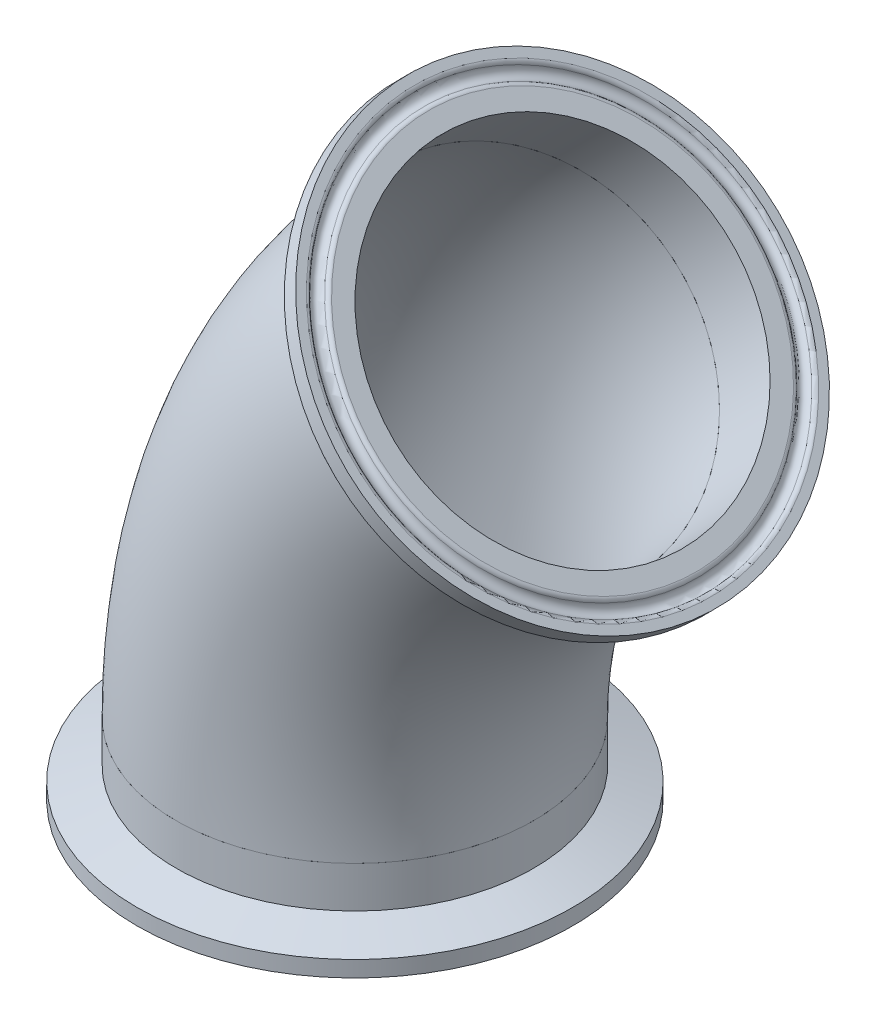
ISO-10303-21;
HEADER;
FILE_DESCRIPTION(('STEP AP214'),'2;1');
FILE_NAME('part.step','',(''),(''),'','','');
FILE_SCHEMA(('AUTOMOTIVE_DESIGN { 1 0 10303 214 1 1 1 1 }'));
ENDSEC;
DATA;
#1=APPLICATION_CONTEXT('core data for automotive mechanical design processes');
#2=APPLICATION_PROTOCOL_DEFINITION('international standard','automotive_design',2000,#1);
#3=PRODUCT_CONTEXT('',#1,'mechanical');
#4=PRODUCT('Part','Part','',(#3));
#5=PRODUCT_RELATED_PRODUCT_CATEGORY('part','',(#4));
#6=PRODUCT_DEFINITION_FORMATION('','',#4);
#7=PRODUCT_DEFINITION_CONTEXT('part definition',#1,'design');
#8=PRODUCT_DEFINITION('design','',#6,#7);
#9=PRODUCT_DEFINITION_SHAPE('','',#8);
#10=(LENGTH_UNIT() NAMED_UNIT(*) SI_UNIT(.MILLI.,.METRE.));
#11=(NAMED_UNIT(*) PLANE_ANGLE_UNIT() SI_UNIT($,.RADIAN.));
#12=(NAMED_UNIT(*) SI_UNIT($,.STERADIAN.) SOLID_ANGLE_UNIT());
#13=UNCERTAINTY_MEASURE_WITH_UNIT(LENGTH_MEASURE(1.E-05),#10,'distance_accuracy_value','');
#14=(GEOMETRIC_REPRESENTATION_CONTEXT(3) GLOBAL_UNCERTAINTY_ASSIGNED_CONTEXT((#13)) GLOBAL_UNIT_ASSIGNED_CONTEXT((#10,
#11,#12)) REPRESENTATION_CONTEXT('',''));
#15=CARTESIAN_POINT('',(0.,0.,0.));
#16=DIRECTION('',(0.,0.,1.));
#17=DIRECTION('',(1.,0.,0.));
#18=AXIS2_PLACEMENT_3D('',#15,#16,#17);
#19=CARTESIAN_POINT('',(113.409405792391,5.14406889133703,55.1188976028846));
#20=DIRECTION('',(0.,0.,1.));
#21=DIRECTION('',(1.,0.,0.));
#22=AXIS2_PLACEMENT_3D('',#19,#20,#21);
#23=TOROIDAL_SURFACE('',#22,95.25,31.75);
#24=CARTESIAN_POINT('',(46.0574848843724,72.495989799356,55.1188976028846));
#25=DIRECTION('',(0.70710678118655,0.707106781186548,0.));
#26=DIRECTION('',(0.,0.,1.));
#27=AXIS2_PLACEMENT_3D('',#24,#25,#26);
#28=CIRCLE('',#27,31.75);
#29=CARTESIAN_POINT('',(23.6068445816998,94.9466301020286,55.1188976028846));
#30=VERTEX_POINT('',#29);
#31=EDGE_CURVE('P0_E10',#30,#30,#28,.T.);
#32=CARTESIAN_POINT('',(18.1594057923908,5.14406889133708,55.1188976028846));
#33=DIRECTION('',(0.,1.,0.));
#34=DIRECTION('',(0.,0.,1.));
#35=AXIS2_PLACEMENT_3D('',#32,#33,#34);
#36=CIRCLE('',#35,31.75);
#37=CARTESIAN_POINT('',(-13.5905942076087,5.14406889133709,55.1188976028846));
#38=VERTEX_POINT('',#37);
#39=EDGE_CURVE('P0_E21',#38,#38,#36,.T.);
#40=CARTESIAN_POINT('',(113.409405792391,5.14406889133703,55.1188976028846));
#41=DIRECTION('',(0.,0.,1.));
#42=DIRECTION('',(1.,0.,0.));
#43=AXIS2_PLACEMENT_3D('',#40,#41,#42);
#44=CIRCLE('',#43,127.);
#45=EDGE_CURVE('',#30,#38,#44,.T.);
#46=ORIENTED_EDGE('',*,*,#31,.F.);
#47=ORIENTED_EDGE('',*,*,#39,.T.);
#48=ORIENTED_EDGE('',*,*,#45,.T.);
#49=ORIENTED_EDGE('',*,*,#45,.F.);
#50=EDGE_LOOP('',(#46,#48,#47,#49));
#51=FACE_BOUND('',#50,.T.);
#52=ADVANCED_FACE('P0_F15',(#51),#23,.T.);
#53=CARTESIAN_POINT('',(46.0574848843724,72.495989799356,55.1188976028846));
#54=DIRECTION('',(0.70710678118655,0.707106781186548,0.));
#55=DIRECTION('',(0.,0.,1.));
#56=AXIS2_PLACEMENT_3D('',#53,#54,#55);
#57=PLANE('',#56);
#58=CARTESIAN_POINT('',(46.0574848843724,72.495989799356,55.1188976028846));
#59=DIRECTION('',(0.70710678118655,0.707106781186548,0.));
#60=DIRECTION('',(-0.707106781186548,0.70710678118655,0.));
#61=AXIS2_PLACEMENT_3D('',#58,#59,#60);
#62=CIRCLE('',#61,30.099);
#63=CARTESIAN_POINT('',(24.7742778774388,93.7791968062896,55.1188976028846));
#64=VERTEX_POINT('',#63);
#65=EDGE_CURVE('P0_E25',#64,#64,#62,.T.);
#66=ORIENTED_EDGE('',*,*,#65,.F.);
#67=EDGE_LOOP('',(#66));
#68=FACE_BOUND('',#67,.T.);
#69=ORIENTED_EDGE('',*,*,#31,.T.);
#70=EDGE_LOOP('',(#69));
#71=FACE_BOUND('',#70,.T.);
#72=ADVANCED_FACE('P0_F46',(#68,#71),#57,.T.);
#73=CARTESIAN_POINT('',(18.1594057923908,5.14406889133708,55.1188976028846));
#74=DIRECTION('',(0.,1.,0.));
#75=DIRECTION('',(0.,0.,1.));
#76=AXIS2_PLACEMENT_3D('',#73,#74,#75);
#77=PLANE('',#76);
#78=CARTESIAN_POINT('',(18.1594057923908,5.14406889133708,55.1188976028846));
#79=DIRECTION('',(0.,1.,0.));
#80=DIRECTION('',(0.,0.,1.));
#81=AXIS2_PLACEMENT_3D('',#78,#79,#80);
#82=CIRCLE('',#81,30.099);
#83=CARTESIAN_POINT('',(-11.9395942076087,5.14406889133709,55.1188976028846));
#84=VERTEX_POINT('',#83);
#85=EDGE_CURVE('P0_E29',#84,#84,#82,.T.);
#86=ORIENTED_EDGE('',*,*,#85,.T.);
#87=EDGE_LOOP('',(#86));
#88=FACE_BOUND('',#87,.T.);
#89=ORIENTED_EDGE('',*,*,#39,.F.);
#90=EDGE_LOOP('',(#89));
#91=FACE_BOUND('',#90,.T.);
#92=ADVANCED_FACE('P0_F35',(#88,#91),#77,.F.);
#93=CARTESIAN_POINT('',(113.409405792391,5.14406889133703,55.1188976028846));
#94=DIRECTION('',(0.,0.,1.));
#95=DIRECTION('',(1.,0.,0.));
#96=AXIS2_PLACEMENT_3D('',#93,#94,#95);
#97=TOROIDAL_SURFACE('',#96,95.25,30.099);
#98=CARTESIAN_POINT('',(113.409405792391,5.14406889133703,55.1188976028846));
#99=DIRECTION('',(0.,0.,1.));
#100=DIRECTION('',(1.,0.,0.));
#101=AXIS2_PLACEMENT_3D('',#98,#99,#100);
#102=CIRCLE('',#101,125.349);
#103=EDGE_CURVE('',#64,#84,#102,.T.);
#104=ORIENTED_EDGE('',*,*,#65,.T.);
#105=ORIENTED_EDGE('',*,*,#85,.F.);
#106=ORIENTED_EDGE('',*,*,#103,.T.);
#107=ORIENTED_EDGE('',*,*,#103,.F.);
#108=EDGE_LOOP('',(#104,#106,#105,#107));
#109=FACE_BOUND('',#108,.T.);
#110=ADVANCED_FACE('P0_F38',(#109),#97,.F.);
#111=CLOSED_SHELL('',(#52,#72,#92,#110));
#112=MANIFOLD_SOLID_BREP('P0_B1',#111);
#113=CARTESIAN_POINT('',(54.4809651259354,80.9194700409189,55.1188976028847));
#114=DIRECTION('',(0.707106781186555,0.707106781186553,0.));
#115=DIRECTION('',(0.595416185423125,-0.595416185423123,-0.539406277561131));
#116=AXIS2_PLACEMENT_3D('',#113,#114,#115);
#117=TOROIDAL_SURFACE('',#116,37.1367084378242,0.787400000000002);
#118=CARTESIAN_POINT('',(55.0377410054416,81.4762459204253,55.1188976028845));
#119=DIRECTION('',(0.707106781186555,0.707106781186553,0.));
#120=DIRECTION('',(0.595416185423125,-0.595416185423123,-0.539406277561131));
#121=AXIS2_PLACEMENT_3D('',#118,#119,#120);
#122=CIRCLE('',#121,37.1367084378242);
#123=CARTESIAN_POINT('',(77.1495382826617,59.3644486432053,35.0871239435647));
#124=VERTEX_POINT('',#123);
#125=EDGE_CURVE('P1_E48',#124,#124,#122,.T.);
#126=ORIENTED_EDGE('',*,*,#125,.T.);
#127=EDGE_LOOP('',(#126));
#128=FACE_BOUND('',#127,.T.);
#129=CARTESIAN_POINT('',(54.7022478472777,81.1407527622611,55.1188976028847));
#130=DIRECTION('',(0.707106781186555,0.707106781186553,0.));
#131=DIRECTION('',(0.595416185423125,-0.595416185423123,-0.539406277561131));
#132=AXIS2_PLACEMENT_3D('',#129,#130,#131);
#133=CIRCLE('',#132,36.4141666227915);
#134=CARTESIAN_POINT('',(76.3838320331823,59.4591685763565,35.476867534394));
#135=VERTEX_POINT('',#134);
#136=EDGE_CURVE('P1_E9',#135,#135,#133,.T.);
#137=ORIENTED_EDGE('',*,*,#136,.F.);
#138=EDGE_LOOP('',(#137));
#139=FACE_BOUND('',#138,.T.);
#140=ADVANCED_FACE('P1_F14',(#128,#139),#117,.T.);
#141=CARTESIAN_POINT('',(55.0377410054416,81.4762459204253,55.1188976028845));
#142=DIRECTION('',(0.707106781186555,0.707106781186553,0.));
#143=DIRECTION('',(0.595416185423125,-0.595416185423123,-0.539406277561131));
#144=AXIS2_PLACEMENT_3D('',#141,#142,#143);
#145=TOROIDAL_SURFACE('',#144,35.3187,1.1938);
#146=CARTESIAN_POINT('',(54.7022478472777,81.1407527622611,55.1188976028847));
#147=DIRECTION('',(0.707106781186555,0.707106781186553,0.));
#148=DIRECTION('',(0.595416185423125,-0.595416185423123,-0.539406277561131));
#149=AXIS2_PLACEMENT_3D('',#146,#147,#148);
#150=CIRCLE('',#149,34.2232333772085);
#151=CARTESIAN_POINT('',(75.0793149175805,60.7636856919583,36.6586706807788));
#152=VERTEX_POINT('',#151);
#153=EDGE_CURVE('P1_E20',#152,#152,#150,.T.);
#154=ORIENTED_EDGE('',*,*,#153,.F.);
#155=EDGE_LOOP('',(#154));
#156=FACE_BOUND('',#155,.T.);
#157=ORIENTED_EDGE('',*,*,#136,.T.);
#158=EDGE_LOOP('',(#157));
#159=FACE_BOUND('',#158,.T.);
#160=ADVANCED_FACE('P1_F97',(#156,#159),#145,.F.);
#161=CARTESIAN_POINT('',(54.4809651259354,80.9194700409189,55.1188976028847));
#162=DIRECTION('',(0.707106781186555,0.707106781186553,0.));
#163=DIRECTION('',(0.595416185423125,-0.595416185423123,-0.539406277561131));
#164=AXIS2_PLACEMENT_3D('',#161,#162,#163);
#165=TOROIDAL_SURFACE('',#164,33.5006915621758,0.787399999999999);
#166=ORIENTED_EDGE('',*,*,#153,.T.);
#167=EDGE_LOOP('',(#166));
#168=FACE_BOUND('',#167,.T.);
#169=CARTESIAN_POINT('',(55.0377410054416,81.4762459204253,55.1188976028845));
#170=DIRECTION('',(0.707106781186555,0.707106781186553,0.));
#171=DIRECTION('',(0.595416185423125,-0.595416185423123,-0.539406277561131));
#172=AXIS2_PLACEMENT_3D('',#169,#170,#171);
#173=CIRCLE('',#172,33.5006915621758);
#174=CARTESIAN_POINT('',(74.984594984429,61.5293919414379,37.0484142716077));
#175=VERTEX_POINT('',#174);
#176=EDGE_CURVE('P1_E24',#175,#175,#173,.T.);
#177=ORIENTED_EDGE('',*,*,#176,.F.);
#178=EDGE_LOOP('',(#177));
#179=FACE_BOUND('',#178,.T.);
#180=ADVANCED_FACE('P1_F93',(#168,#179),#165,.T.);
#181=CARTESIAN_POINT('',(55.0377410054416,81.4762459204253,55.1188976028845));
#182=DIRECTION('',(-0.707106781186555,-0.707106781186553,0.));
#183=DIRECTION('',(-0.595416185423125,0.595416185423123,0.539406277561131));
#184=AXIS2_PLACEMENT_3D('',#181,#182,#183);
#185=PLANE('',#184);
#186=CARTESIAN_POINT('',(55.0377410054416,81.4762459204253,55.1188976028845));
#187=DIRECTION('',(0.707106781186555,0.707106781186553,0.));
#188=DIRECTION('',(0.595416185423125,-0.595416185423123,-0.539406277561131));
#189=AXIS2_PLACEMENT_3D('',#186,#187,#188);
#190=CIRCLE('',#189,30.099);
#191=CARTESIAN_POINT('',(72.9591727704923,63.5548141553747,38.8833080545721));
#192=VERTEX_POINT('',#191);
#193=EDGE_CURVE('P1_E28',#192,#192,#190,.T.);
#194=ORIENTED_EDGE('',*,*,#193,.F.);
#195=EDGE_LOOP('',(#194));
#196=FACE_BOUND('',#195,.T.);
#197=ORIENTED_EDGE('',*,*,#176,.T.);
#198=EDGE_LOOP('',(#197));
#199=FACE_BOUND('',#198,.T.);
#200=ADVANCED_FACE('P1_F86',(#196,#199),#185,.F.);
#201=CARTESIAN_POINT('',(55.0377410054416,81.4762459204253,55.1188976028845));
#202=DIRECTION('',(0.707106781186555,0.707106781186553,0.));
#203=DIRECTION('',(0.595416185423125,-0.595416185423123,-0.539406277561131));
#204=AXIS2_PLACEMENT_3D('',#201,#202,#203);
#205=CYLINDRICAL_SURFACE('',#204,30.099);
#206=ORIENTED_EDGE('',*,*,#193,.T.);
#207=EDGE_LOOP('',(#206));
#208=FACE_BOUND('',#207,.T.);
#209=CARTESIAN_POINT('',(46.0574848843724,72.495989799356,55.1188976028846));
#210=DIRECTION('',(0.707106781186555,0.707106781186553,0.));
#211=DIRECTION('',(0.595416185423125,-0.595416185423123,-0.539406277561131));
#212=AXIS2_PLACEMENT_3D('',#209,#210,#211);
#213=CIRCLE('',#212,30.099);
#214=CARTESIAN_POINT('',(63.9789166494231,54.5745580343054,38.8833080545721));
#215=VERTEX_POINT('',#214);
#216=EDGE_CURVE('P1_E33',#215,#215,#213,.T.);
#217=ORIENTED_EDGE('',*,*,#216,.F.);
#218=EDGE_LOOP('',(#217));
#219=FACE_BOUND('',#218,.T.);
#220=ADVANCED_FACE('P1_F81',(#208,#219),#205,.F.);
#221=CARTESIAN_POINT('',(46.0574848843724,72.495989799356,55.1188976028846));
#222=DIRECTION('',(0.707106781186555,0.707106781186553,0.));
#223=DIRECTION('',(0.595416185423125,-0.595416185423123,-0.539406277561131));
#224=AXIS2_PLACEMENT_3D('',#221,#222,#223);
#225=PLANE('',#224);
#226=CARTESIAN_POINT('',(46.0574848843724,72.495989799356,55.1188976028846));
#227=DIRECTION('',(0.707106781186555,0.707106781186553,0.));
#228=DIRECTION('',(0.595416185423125,-0.595416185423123,-0.539406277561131));
#229=AXIS2_PLACEMENT_3D('',#226,#227,#228);
#230=CIRCLE('',#229,31.75);
#231=CARTESIAN_POINT('',(64.9619487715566,53.5915259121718,37.9927482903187));
#232=VERTEX_POINT('',#231);
#233=EDGE_CURVE('P1_E36',#232,#232,#230,.T.);
#234=ORIENTED_EDGE('',*,*,#233,.F.);
#235=EDGE_LOOP('',(#234));
#236=FACE_BOUND('',#235,.T.);
#237=ORIENTED_EDGE('',*,*,#216,.T.);
#238=EDGE_LOOP('',(#237));
#239=FACE_BOUND('',#238,.T.);
#240=ADVANCED_FACE('P1_F75',(#236,#239),#225,.F.);
#241=CARTESIAN_POINT('',(55.0377410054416,81.4762459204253,55.1188976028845));
#242=DIRECTION('',(0.707106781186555,0.707106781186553,0.));
#243=DIRECTION('',(0.595416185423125,-0.595416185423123,-0.539406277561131));
#244=AXIS2_PLACEMENT_3D('',#241,#242,#243);
#245=CYLINDRICAL_SURFACE('',#244,31.75);
#246=CARTESIAN_POINT('',(51.2350004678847,77.6735053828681,55.1188976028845));
#247=DIRECTION('',(0.707106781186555,0.707106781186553,0.));
#248=DIRECTION('',(0.595416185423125,-0.595416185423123,-0.539406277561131));
#249=AXIS2_PLACEMENT_3D('',#246,#247,#248);
#250=CIRCLE('',#249,31.75);
#251=CARTESIAN_POINT('',(70.1394643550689,58.7690414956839,37.9927482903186));
#252=VERTEX_POINT('',#251);
#253=EDGE_CURVE('P1_E39',#252,#252,#250,.T.);
#254=ORIENTED_EDGE('',*,*,#253,.F.);
#255=EDGE_LOOP('',(#254));
#256=FACE_BOUND('',#255,.T.);
#257=ORIENTED_EDGE('',*,*,#233,.T.);
#258=EDGE_LOOP('',(#257));
#259=FACE_BOUND('',#258,.T.);
#260=ADVANCED_FACE('P1_F69',(#256,#259),#245,.T.);
#261=CARTESIAN_POINT('',(51.2350004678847,77.6735053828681,55.1188976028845));
#262=DIRECTION('',(0.707106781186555,0.707106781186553,0.));
#263=DIRECTION('',(0.595416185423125,-0.595416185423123,-0.539406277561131));
#264=AXIS2_PLACEMENT_3D('',#261,#262,#263);
#265=CONICAL_SURFACE('',#264,31.75,1.22173047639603);
#266=CARTESIAN_POINT('',(53.0261636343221,79.4646685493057,55.1188976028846));
#267=DIRECTION('',(0.707106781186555,0.707106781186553,0.));
#268=DIRECTION('',(0.595416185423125,-0.595416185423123,-0.539406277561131));
#269=AXIS2_PLACEMENT_3D('',#266,#267,#268);
#270=CIRCLE('',#269,38.7096);
#271=CARTESIAN_POINT('',(76.0744860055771,56.4163461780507,34.2386963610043));
#272=VERTEX_POINT('',#271);
#273=EDGE_CURVE('P1_E42',#272,#272,#270,.T.);
#274=ORIENTED_EDGE('',*,*,#273,.F.);
#275=EDGE_LOOP('',(#274));
#276=FACE_BOUND('',#275,.T.);
#277=ORIENTED_EDGE('',*,*,#253,.T.);
#278=EDGE_LOOP('',(#277));
#279=FACE_BOUND('',#278,.T.);
#280=ADVANCED_FACE('P1_F63',(#276,#279),#265,.T.);
#281=CARTESIAN_POINT('',(55.0377410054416,81.4762459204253,55.1188976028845));
#282=DIRECTION('',(0.707106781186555,0.707106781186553,0.));
#283=DIRECTION('',(0.595416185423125,-0.595416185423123,-0.539406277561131));
#284=AXIS2_PLACEMENT_3D('',#281,#282,#283);
#285=CYLINDRICAL_SURFACE('',#284,38.7096);
#286=CARTESIAN_POINT('',(55.0377410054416,81.4762459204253,55.1188976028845));
#287=DIRECTION('',(0.707106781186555,0.707106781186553,0.));
#288=DIRECTION('',(0.595416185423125,-0.595416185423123,-0.539406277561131));
#289=AXIS2_PLACEMENT_3D('',#286,#287,#288);
#290=CIRCLE('',#289,38.7096);
#291=CARTESIAN_POINT('',(78.0860633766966,58.4279235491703,34.2386963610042));
#292=VERTEX_POINT('',#291);
#293=EDGE_CURVE('P1_E45',#292,#292,#290,.T.);
#294=ORIENTED_EDGE('',*,*,#293,.F.);
#295=EDGE_LOOP('',(#294));
#296=FACE_BOUND('',#295,.T.);
#297=ORIENTED_EDGE('',*,*,#273,.T.);
#298=EDGE_LOOP('',(#297));
#299=FACE_BOUND('',#298,.T.);
#300=ADVANCED_FACE('P1_F57',(#296,#299),#285,.T.);
#301=CARTESIAN_POINT('',(55.0377410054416,81.4762459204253,55.1188976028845));
#302=DIRECTION('',(-0.707106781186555,-0.707106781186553,0.));
#303=DIRECTION('',(-0.595416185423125,0.595416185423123,0.539406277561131));
#304=AXIS2_PLACEMENT_3D('',#301,#302,#303);
#305=PLANE('',#304);
#306=ORIENTED_EDGE('',*,*,#125,.F.);
#307=EDGE_LOOP('',(#306));
#308=FACE_BOUND('',#307,.T.);
#309=ORIENTED_EDGE('',*,*,#293,.T.);
#310=EDGE_LOOP('',(#309));
#311=FACE_BOUND('',#310,.T.);
#312=ADVANCED_FACE('P1_F54',(#308,#311),#305,.F.);
#313=CLOSED_SHELL('',(#140,#160,#180,#200,#220,#240,#260,#280,#300,#312));
#314=MANIFOLD_SOLID_BREP('P1_B1',#313);
#315=CARTESIAN_POINT('',(18.1594057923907,-6.76853110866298,55.1188976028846));
#316=DIRECTION('',(0.,-1.00000000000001,0.));
#317=DIRECTION('',(0.,0.,-1.));
#318=AXIS2_PLACEMENT_3D('',#315,#316,#317);
#319=TOROIDAL_SURFACE('',#318,37.1367084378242,0.787400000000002);
#320=CARTESIAN_POINT('',(18.1594057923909,-7.55593110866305,55.1188976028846));
#321=DIRECTION('',(0.,-1.00000000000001,0.));
#322=DIRECTION('',(0.,0.,-1.));
#323=AXIS2_PLACEMENT_3D('',#320,#321,#322);
#324=CIRCLE('',#323,37.1367084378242);
#325=CARTESIAN_POINT('',(18.1594057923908,-7.5559311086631,17.9821891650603));
#326=VERTEX_POINT('',#325);
#327=EDGE_CURVE('P2_E49',#326,#326,#324,.T.);
#328=ORIENTED_EDGE('',*,*,#327,.T.);
#329=EDGE_LOOP('',(#328));
#330=FACE_BOUND('',#329,.T.);
#331=CARTESIAN_POINT('',(18.1594057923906,-7.08147213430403,55.1188976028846));
#332=DIRECTION('',(0.,-1.00000000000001,0.));
#333=DIRECTION('',(0.,0.,-1.));
#334=AXIS2_PLACEMENT_3D('',#331,#332,#333);
#335=CIRCLE('',#334,36.4141666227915);
#336=CARTESIAN_POINT('',(18.1594057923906,-7.08147213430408,18.704730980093));
#337=VERTEX_POINT('',#336);
#338=EDGE_CURVE('P2_E10',#337,#337,#335,.T.);
#339=ORIENTED_EDGE('',*,*,#338,.F.);
#340=EDGE_LOOP('',(#339));
#341=FACE_BOUND('',#340,.T.);
#342=ADVANCED_FACE('P2_F15',(#330,#341),#319,.T.);
#343=CARTESIAN_POINT('',(18.1594057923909,-7.55593110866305,55.1188976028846));
#344=DIRECTION('',(0.,-1.00000000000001,0.));
#345=DIRECTION('',(0.,0.,-1.));
#346=AXIS2_PLACEMENT_3D('',#343,#344,#345);
#347=TOROIDAL_SURFACE('',#346,35.3187,1.1938);
#348=CARTESIAN_POINT('',(18.1594057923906,-7.08147213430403,55.1188976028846));
#349=DIRECTION('',(0.,-1.00000000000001,0.));
#350=DIRECTION('',(0.,0.,-1.));
#351=AXIS2_PLACEMENT_3D('',#348,#349,#350);
#352=CIRCLE('',#351,34.2232333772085);
#353=CARTESIAN_POINT('',(18.1594057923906,-7.08147213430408,20.895664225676));
#354=VERTEX_POINT('',#353);
#355=EDGE_CURVE('P2_E21',#354,#354,#352,.T.);
#356=ORIENTED_EDGE('',*,*,#355,.F.);
#357=EDGE_LOOP('',(#356));
#358=FACE_BOUND('',#357,.T.);
#359=ORIENTED_EDGE('',*,*,#338,.T.);
#360=EDGE_LOOP('',(#359));
#361=FACE_BOUND('',#360,.T.);
#362=ADVANCED_FACE('P2_F98',(#358,#361),#347,.F.);
#363=CARTESIAN_POINT('',(18.1594057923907,-6.76853110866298,55.1188976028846));
#364=DIRECTION('',(0.,-1.00000000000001,0.));
#365=DIRECTION('',(0.,0.,-1.));
#366=AXIS2_PLACEMENT_3D('',#363,#364,#365);
#367=TOROIDAL_SURFACE('',#366,33.5006915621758,0.787399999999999);
#368=ORIENTED_EDGE('',*,*,#355,.T.);
#369=EDGE_LOOP('',(#368));
#370=FACE_BOUND('',#369,.T.);
#371=CARTESIAN_POINT('',(18.1594057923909,-7.55593110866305,55.1188976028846));
#372=DIRECTION('',(0.,-1.00000000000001,0.));
#373=DIRECTION('',(0.,0.,-1.));
#374=AXIS2_PLACEMENT_3D('',#371,#372,#373);
#375=CIRCLE('',#374,33.5006915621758);
#376=CARTESIAN_POINT('',(18.1594057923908,-7.5559311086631,21.6182060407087));
#377=VERTEX_POINT('',#376);
#378=EDGE_CURVE('P2_E25',#377,#377,#375,.T.);
#379=ORIENTED_EDGE('',*,*,#378,.F.);
#380=EDGE_LOOP('',(#379));
#381=FACE_BOUND('',#380,.T.);
#382=ADVANCED_FACE('P2_F94',(#370,#381),#367,.T.);
#383=CARTESIAN_POINT('',(18.1594057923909,-7.55593110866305,55.1188976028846));
#384=DIRECTION('',(0.,1.00000000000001,0.));
#385=DIRECTION('',(0.,0.,1.));
#386=AXIS2_PLACEMENT_3D('',#383,#384,#385);
#387=PLANE('',#386);
#388=CARTESIAN_POINT('',(18.1594057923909,-7.55593110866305,55.1188976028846));
#389=DIRECTION('',(0.,-1.00000000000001,0.));
#390=DIRECTION('',(0.,0.,-1.));
#391=AXIS2_PLACEMENT_3D('',#388,#389,#390);
#392=CIRCLE('',#391,30.099);
#393=CARTESIAN_POINT('',(18.1594057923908,-7.55593110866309,25.0198976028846));
#394=VERTEX_POINT('',#393);
#395=EDGE_CURVE('P2_E29',#394,#394,#392,.T.);
#396=ORIENTED_EDGE('',*,*,#395,.F.);
#397=EDGE_LOOP('',(#396));
#398=FACE_BOUND('',#397,.T.);
#399=ORIENTED_EDGE('',*,*,#378,.T.);
#400=EDGE_LOOP('',(#399));
#401=FACE_BOUND('',#400,.T.);
#402=ADVANCED_FACE('P2_F87',(#398,#401),#387,.F.);
#403=CARTESIAN_POINT('',(18.1594057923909,-7.55593110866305,55.1188976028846));
#404=DIRECTION('',(0.,-1.00000000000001,0.));
#405=DIRECTION('',(0.,0.,-1.));
#406=AXIS2_PLACEMENT_3D('',#403,#404,#405);
#407=CYLINDRICAL_SURFACE('',#406,30.099);
#408=ORIENTED_EDGE('',*,*,#395,.T.);
#409=EDGE_LOOP('',(#408));
#410=FACE_BOUND('',#409,.T.);
#411=CARTESIAN_POINT('',(18.1594057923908,5.14406889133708,55.1188976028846));
#412=DIRECTION('',(0.,-1.00000000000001,0.));
#413=DIRECTION('',(0.,0.,-1.));
#414=AXIS2_PLACEMENT_3D('',#411,#412,#413);
#415=CIRCLE('',#414,30.099);
#416=CARTESIAN_POINT('',(18.1594057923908,5.14406889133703,25.0198976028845));
#417=VERTEX_POINT('',#416);
#418=EDGE_CURVE('P2_E34',#417,#417,#415,.T.);
#419=ORIENTED_EDGE('',*,*,#418,.F.);
#420=EDGE_LOOP('',(#419));
#421=FACE_BOUND('',#420,.T.);
#422=ADVANCED_FACE('P2_F82',(#410,#421),#407,.F.);
#423=CARTESIAN_POINT('',(18.1594057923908,5.14406889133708,55.1188976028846));
#424=DIRECTION('',(0.,-1.00000000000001,0.));
#425=DIRECTION('',(0.,0.,-1.));
#426=AXIS2_PLACEMENT_3D('',#423,#424,#425);
#427=PLANE('',#426);
#428=CARTESIAN_POINT('',(18.1594057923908,5.14406889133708,55.1188976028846));
#429=DIRECTION('',(0.,-1.00000000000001,0.));
#430=DIRECTION('',(0.,0.,-1.));
#431=AXIS2_PLACEMENT_3D('',#428,#429,#430);
#432=CIRCLE('',#431,31.75);
#433=CARTESIAN_POINT('',(18.1594057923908,5.14406889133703,23.3688976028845));
#434=VERTEX_POINT('',#433);
#435=EDGE_CURVE('P2_E37',#434,#434,#432,.T.);
#436=ORIENTED_EDGE('',*,*,#435,.F.);
#437=EDGE_LOOP('',(#436));
#438=FACE_BOUND('',#437,.T.);
#439=ORIENTED_EDGE('',*,*,#418,.T.);
#440=EDGE_LOOP('',(#439));
#441=FACE_BOUND('',#440,.T.);
#442=ADVANCED_FACE('P2_F76',(#438,#441),#427,.F.);
#443=CARTESIAN_POINT('',(18.1594057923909,-7.55593110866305,55.1188976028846));
#444=DIRECTION('',(0.,-1.00000000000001,0.));
#445=DIRECTION('',(0.,0.,-1.));
#446=AXIS2_PLACEMENT_3D('',#443,#444,#445);
#447=CYLINDRICAL_SURFACE('',#446,31.75);
#448=CARTESIAN_POINT('',(18.1594057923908,-2.17804386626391,55.1188976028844));
#449=DIRECTION('',(0.,-1.00000000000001,0.));
#450=DIRECTION('',(0.,0.,-1.));
#451=AXIS2_PLACEMENT_3D('',#448,#449,#450);
#452=CIRCLE('',#451,31.75);
#453=CARTESIAN_POINT('',(18.1594057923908,-2.17804386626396,23.3688976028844));
#454=VERTEX_POINT('',#453);
#455=EDGE_CURVE('P2_E40',#454,#454,#452,.T.);
#456=ORIENTED_EDGE('',*,*,#455,.F.);
#457=EDGE_LOOP('',(#456));
#458=FACE_BOUND('',#457,.T.);
#459=ORIENTED_EDGE('',*,*,#435,.T.);
#460=EDGE_LOOP('',(#459));
#461=FACE_BOUND('',#460,.T.);
#462=ADVANCED_FACE('P2_F70',(#458,#461),#447,.T.);
#463=CARTESIAN_POINT('',(18.1594057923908,-2.17804386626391,55.1188976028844));
#464=DIRECTION('',(0.,-1.00000000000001,0.));
#465=DIRECTION('',(0.,0.,-1.));
#466=AXIS2_PLACEMENT_3D('',#463,#464,#465);
#467=CONICAL_SURFACE('',#466,31.75,1.22173047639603);
#468=CARTESIAN_POINT('',(18.1594057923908,-4.71113110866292,55.1188976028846));
#469=DIRECTION('',(0.,-1.00000000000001,0.));
#470=DIRECTION('',(0.,0.,-1.));
#471=AXIS2_PLACEMENT_3D('',#468,#469,#470);
#472=CIRCLE('',#471,38.7096);
#473=CARTESIAN_POINT('',(18.1594057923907,-4.71113110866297,16.4092976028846));
#474=VERTEX_POINT('',#473);
#475=EDGE_CURVE('P2_E43',#474,#474,#472,.T.);
#476=ORIENTED_EDGE('',*,*,#475,.F.);
#477=EDGE_LOOP('',(#476));
#478=FACE_BOUND('',#477,.T.);
#479=ORIENTED_EDGE('',*,*,#455,.T.);
#480=EDGE_LOOP('',(#479));
#481=FACE_BOUND('',#480,.T.);
#482=ADVANCED_FACE('P2_F64',(#478,#481),#467,.T.);
#483=CARTESIAN_POINT('',(18.1594057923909,-7.55593110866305,55.1188976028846));
#484=DIRECTION('',(0.,-1.00000000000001,0.));
#485=DIRECTION('',(0.,0.,-1.));
#486=AXIS2_PLACEMENT_3D('',#483,#484,#485);
#487=CYLINDRICAL_SURFACE('',#486,38.7096);
#488=CARTESIAN_POINT('',(18.1594057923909,-7.55593110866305,55.1188976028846));
#489=DIRECTION('',(0.,-1.00000000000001,0.));
#490=DIRECTION('',(0.,0.,-1.));
#491=AXIS2_PLACEMENT_3D('',#488,#489,#490);
#492=CIRCLE('',#491,38.7096);
#493=CARTESIAN_POINT('',(18.1594057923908,-7.55593110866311,16.4092976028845));
#494=VERTEX_POINT('',#493);
#495=EDGE_CURVE('P2_E46',#494,#494,#492,.T.);
#496=ORIENTED_EDGE('',*,*,#495,.F.);
#497=EDGE_LOOP('',(#496));
#498=FACE_BOUND('',#497,.T.);
#499=ORIENTED_EDGE('',*,*,#475,.T.);
#500=EDGE_LOOP('',(#499));
#501=FACE_BOUND('',#500,.T.);
#502=ADVANCED_FACE('P2_F58',(#498,#501),#487,.T.);
#503=CARTESIAN_POINT('',(18.1594057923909,-7.55593110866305,55.1188976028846));
#504=DIRECTION('',(0.,1.00000000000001,0.));
#505=DIRECTION('',(0.,0.,1.));
#506=AXIS2_PLACEMENT_3D('',#503,#504,#505);
#507=PLANE('',#506);
#508=ORIENTED_EDGE('',*,*,#327,.F.);
#509=EDGE_LOOP('',(#508));
#510=FACE_BOUND('',#509,.T.);
#511=ORIENTED_EDGE('',*,*,#495,.T.);
#512=EDGE_LOOP('',(#511));
#513=FACE_BOUND('',#512,.T.);
#514=ADVANCED_FACE('P2_F55',(#510,#513),#507,.F.);
#515=CLOSED_SHELL('',(#342,#362,#382,#402,#422,#442,#462,#482,#502,#514));
#516=MANIFOLD_SOLID_BREP('P2_B1',#515);
#517=ADVANCED_BREP_SHAPE_REPRESENTATION('',(#18,#112,#314,#516),#14);
#518=SHAPE_DEFINITION_REPRESENTATION(#9,#517);
ENDSEC;
END-ISO-10303-21;
